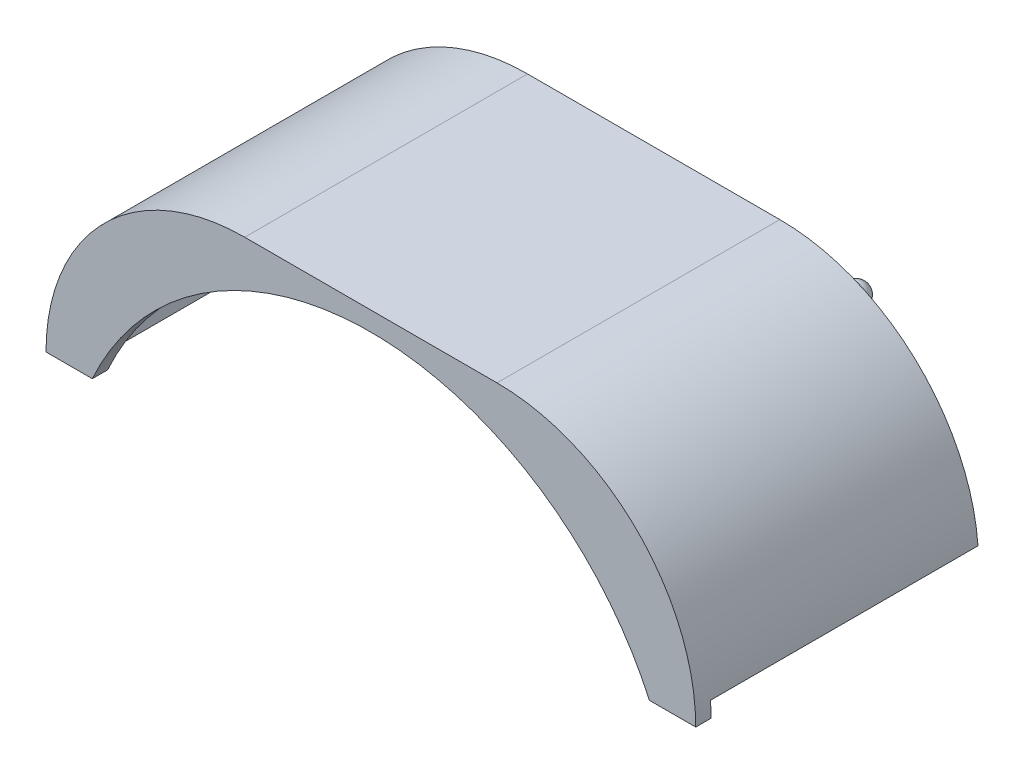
ISO-10303-21;
HEADER;
FILE_DESCRIPTION(('STEP AP214'),'2;1');
FILE_NAME('part.step','',(''),(''),'','','');
FILE_SCHEMA(('AUTOMOTIVE_DESIGN { 1 0 10303 214 1 1 1 1 }'));
ENDSEC;
DATA;
#1=APPLICATION_CONTEXT('core data for automotive mechanical design processes');
#2=APPLICATION_PROTOCOL_DEFINITION('international standard','automotive_design',2000,#1);
#3=PRODUCT_CONTEXT('',#1,'mechanical');
#4=PRODUCT('Part','Part','',(#3));
#5=PRODUCT_RELATED_PRODUCT_CATEGORY('part','',(#4));
#6=PRODUCT_DEFINITION_FORMATION('','',#4);
#7=PRODUCT_DEFINITION_CONTEXT('part definition',#1,'design');
#8=PRODUCT_DEFINITION('design','',#6,#7);
#9=PRODUCT_DEFINITION_SHAPE('','',#8);
#10=(LENGTH_UNIT() NAMED_UNIT(*) SI_UNIT(.MILLI.,.METRE.));
#11=(NAMED_UNIT(*) PLANE_ANGLE_UNIT() SI_UNIT($,.RADIAN.));
#12=(NAMED_UNIT(*) SI_UNIT($,.STERADIAN.) SOLID_ANGLE_UNIT());
#13=UNCERTAINTY_MEASURE_WITH_UNIT(LENGTH_MEASURE(1.E-05),#10,'distance_accuracy_value','');
#14=(GEOMETRIC_REPRESENTATION_CONTEXT(3) GLOBAL_UNCERTAINTY_ASSIGNED_CONTEXT((#13)) GLOBAL_UNIT_ASSIGNED_CONTEXT((#10,
#11,#12)) REPRESENTATION_CONTEXT('',''));
#15=CARTESIAN_POINT('',(0.,0.,0.));
#16=DIRECTION('',(0.,0.,1.));
#17=DIRECTION('',(1.,0.,0.));
#18=AXIS2_PLACEMENT_3D('',#15,#16,#17);
#19=CARTESIAN_POINT('',(-16.5000000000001,16.5,-2.07368844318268E-10));
#20=DIRECTION('',(0.,0.,1.));
#21=DIRECTION('',(1.,0.,0.));
#22=AXIS2_PLACEMENT_3D('',#19,#20,#21);
#23=PLANE('',#22);
#24=CARTESIAN_POINT('',(25.,37.5000000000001,0.));
#25=DIRECTION('',(0.,0.,-1.));
#26=DIRECTION('',(-1.,0.,0.));
#27=AXIS2_PLACEMENT_3D('',#24,#25,#26);
#28=CIRCLE('',#27,1.5);
#29=CARTESIAN_POINT('',(23.5,37.5000000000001,0.));
#30=VERTEX_POINT('',#29);
#31=CARTESIAN_POINT('',(26.5,37.5000000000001,-2.07368844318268E-10));
#32=VERTEX_POINT('',#31);
#33=EDGE_CURVE('E294',#30,#32,#28,.T.);
#34=ORIENTED_EDGE('',*,*,#33,.F.);
#35=DIRECTION('',(0.,-1.,0.));
#36=VECTOR('',#35,1.);
#37=CARTESIAN_POINT('',(23.5,37.5000000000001,-2.07368844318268E-10));
#38=LINE('',#37,#36);
#39=CARTESIAN_POINT('',(23.5,40.5000000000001,-2.07368844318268E-10));
#40=VERTEX_POINT('',#39);
#41=EDGE_CURVE('E298',#40,#30,#38,.T.);
#42=ORIENTED_EDGE('',*,*,#41,.F.);
#43=CARTESIAN_POINT('',(16.5000000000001,16.5,-2.07368844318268E-10));
#44=DIRECTION('',(0.,0.,-1.));
#45=DIRECTION('',(1.,0.,0.));
#46=AXIS2_PLACEMENT_3D('',#43,#44,#45);
#47=CIRCLE('',#46,25.0000000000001);
#48=CARTESIAN_POINT('',(18.,41.4549594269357,0.));
#49=VERTEX_POINT('',#48);
#50=EDGE_CURVE('E320',#49,#40,#47,.T.);
#51=ORIENTED_EDGE('',*,*,#50,.F.);
#52=DIRECTION('',(0.,-1.,0.));
#53=VECTOR('',#52,1.);
#54=CARTESIAN_POINT('',(18.,37.5000000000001,0.));
#55=LINE('',#54,#53);
#56=CARTESIAN_POINT('',(18.,41.5000000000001,0.));
#57=VERTEX_POINT('',#56);
#58=EDGE_CURVE('E633',#57,#49,#55,.T.);
#59=ORIENTED_EDGE('',*,*,#58,.F.);
#60=DIRECTION('',(1.,0.,0.));
#61=VECTOR('',#60,1.);
#62=CARTESIAN_POINT('',(-16.,41.5000000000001,-2.07368844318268E-10));
#63=LINE('',#62,#61);
#64=CARTESIAN_POINT('',(-18.,41.5000000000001,0.));
#65=VERTEX_POINT('',#64);
#66=EDGE_CURVE('E324',#65,#57,#63,.T.);
#67=ORIENTED_EDGE('',*,*,#66,.F.);
#68=DIRECTION('',(0.,1.,0.));
#69=VECTOR('',#68,1.);
#70=CARTESIAN_POINT('',(-18.,37.5000000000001,0.));
#71=LINE('',#70,#69);
#72=CARTESIAN_POINT('',(-18.,41.4549594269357,0.));
#73=VERTEX_POINT('',#72);
#74=EDGE_CURVE('E659',#73,#65,#71,.T.);
#75=ORIENTED_EDGE('',*,*,#74,.F.);
#76=CARTESIAN_POINT('',(-16.5000000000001,16.5,-2.07368844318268E-10));
#77=DIRECTION('',(0.,0.,-1.));
#78=DIRECTION('',(1.,0.,0.));
#79=AXIS2_PLACEMENT_3D('',#76,#77,#78);
#80=CIRCLE('',#79,25.0000000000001);
#81=CARTESIAN_POINT('',(-23.5,40.5000000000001,-2.07368844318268E-10));
#82=VERTEX_POINT('',#81);
#83=EDGE_CURVE('E620',#82,#73,#80,.T.);
#84=ORIENTED_EDGE('',*,*,#83,.F.);
#85=DIRECTION('',(0.,1.,0.));
#86=VECTOR('',#85,1.);
#87=CARTESIAN_POINT('',(-23.5,40.5000000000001,-2.07368844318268E-10));
#88=LINE('',#87,#86);
#89=CARTESIAN_POINT('',(-23.5,37.5000000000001,-2.07368844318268E-10));
#90=VERTEX_POINT('',#89);
#91=EDGE_CURVE('E617',#90,#82,#88,.T.);
#92=ORIENTED_EDGE('',*,*,#91,.F.);
#93=CARTESIAN_POINT('',(-25.,37.5000000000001,0.));
#94=DIRECTION('',(0.,0.,-1.));
#95=DIRECTION('',(-1.,0.,0.));
#96=AXIS2_PLACEMENT_3D('',#93,#94,#95);
#97=CIRCLE('',#96,1.50000000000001);
#98=CARTESIAN_POINT('',(-26.5,37.5000000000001,0.));
#99=VERTEX_POINT('',#98);
#100=EDGE_CURVE('E305',#99,#90,#97,.T.);
#101=ORIENTED_EDGE('',*,*,#100,.F.);
#102=DIRECTION('',(0.,-1.,0.));
#103=VECTOR('',#102,1.);
#104=CARTESIAN_POINT('',(-26.5,37.5000000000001,-2.07368844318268E-10));
#105=LINE('',#104,#103);
#106=CARTESIAN_POINT('',(-26.5,39.4128784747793,-2.07368844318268E-10));
#107=VERTEX_POINT('',#106);
#108=EDGE_CURVE('E614',#107,#99,#105,.T.);
#109=ORIENTED_EDGE('',*,*,#108,.F.);
#110=CARTESIAN_POINT('',(-16.5000000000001,16.5,-2.07368844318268E-10));
#111=DIRECTION('',(0.,0.,-1.));
#112=DIRECTION('',(1.,0.,0.));
#113=AXIS2_PLACEMENT_3D('',#110,#111,#112);
#114=CIRCLE('',#113,25.0000000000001);
#115=CARTESIAN_POINT('',(-38.5000000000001,28.374342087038,-2.07368844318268E-10));
#116=VERTEX_POINT('',#115);
#117=EDGE_CURVE('E612',#116,#107,#114,.T.);
#118=ORIENTED_EDGE('',*,*,#117,.F.);
#119=DIRECTION('',(0.,1.,0.));
#120=VECTOR('',#119,1.);
#121=CARTESIAN_POINT('',(-38.5000000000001,16.5,-2.07368844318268E-10));
#122=LINE('',#121,#120);
#123=CARTESIAN_POINT('',(-38.5000000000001,16.5,-2.07368844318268E-10));
#124=VERTEX_POINT('',#123);
#125=EDGE_CURVE('E593',#124,#116,#122,.T.);
#126=ORIENTED_EDGE('',*,*,#125,.F.);
#127=DIRECTION('',(1.,0.,0.));
#128=VECTOR('',#127,1.);
#129=CARTESIAN_POINT('',(-39.5000000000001,16.5,-2.07368844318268E-10));
#130=LINE('',#129,#128);
#131=CARTESIAN_POINT('',(-39.5000000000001,16.5,-2.07368844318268E-10));
#132=VERTEX_POINT('',#131);
#133=EDGE_CURVE('E607',#132,#124,#130,.T.);
#134=ORIENTED_EDGE('',*,*,#133,.F.);
#135=DIRECTION('',(0.,-1.,0.));
#136=VECTOR('',#135,1.);
#137=CARTESIAN_POINT('',(-39.5000000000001,16.5,-2.07368844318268E-10));
#138=LINE('',#137,#136);
#139=CARTESIAN_POINT('',(-39.5000000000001,18.5,-2.07368844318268E-10));
#140=VERTEX_POINT('',#139);
#141=EDGE_CURVE('E354',#140,#132,#138,.T.);
#142=ORIENTED_EDGE('',*,*,#141,.F.);
#143=DIRECTION('',(1.,0.,0.));
#144=VECTOR('',#143,1.);
#145=CARTESIAN_POINT('',(-39.5000000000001,18.5,-2.07368844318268E-10));
#146=LINE('',#145,#144);
#147=CARTESIAN_POINT('',(-42.4229627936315,18.5,-2.07368844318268E-10));
#148=VERTEX_POINT('',#147);
#149=EDGE_CURVE('E351',#148,#140,#146,.T.);
#150=ORIENTED_EDGE('',*,*,#149,.F.);
#151=CARTESIAN_POINT('',(-16.5000000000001,16.5,-2.07368844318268E-10));
#152=DIRECTION('',(0.,0.,1.));
#153=DIRECTION('',(1.,0.,0.));
#154=AXIS2_PLACEMENT_3D('',#151,#152,#153);
#155=CIRCLE('',#154,26.);
#156=CARTESIAN_POINT('',(-16.5000000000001,42.5,-2.07368844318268E-10));
#157=VERTEX_POINT('',#156);
#158=EDGE_CURVE('E348',#157,#148,#155,.T.);
#159=ORIENTED_EDGE('',*,*,#158,.F.);
#160=DIRECTION('',(-1.,0.,0.));
#161=VECTOR('',#160,1.);
#162=CARTESIAN_POINT('',(16.5000000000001,42.5000000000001,-2.07368844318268E-10));
#163=LINE('',#162,#161);
#164=CARTESIAN_POINT('',(16.5000000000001,42.5000000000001,-2.07368844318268E-10));
#165=VERTEX_POINT('',#164);
#166=EDGE_CURVE('E345',#165,#157,#163,.T.);
#167=ORIENTED_EDGE('',*,*,#166,.F.);
#168=CARTESIAN_POINT('',(16.5000000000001,16.5,-2.07368844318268E-10));
#169=DIRECTION('',(0.,0.,1.));
#170=DIRECTION('',(1.,0.,0.));
#171=AXIS2_PLACEMENT_3D('',#168,#169,#170);
#172=CIRCLE('',#171,26.0000000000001);
#173=CARTESIAN_POINT('',(42.4229627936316,18.5,-2.07368844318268E-10));
#174=VERTEX_POINT('',#173);
#175=EDGE_CURVE('E342',#174,#165,#172,.T.);
#176=ORIENTED_EDGE('',*,*,#175,.F.);
#177=DIRECTION('',(1.,0.,0.));
#178=VECTOR('',#177,1.);
#179=CARTESIAN_POINT('',(39.5000000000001,18.5,-2.07368844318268E-10));
#180=LINE('',#179,#178);
#181=CARTESIAN_POINT('',(39.5000000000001,18.5,-2.07368844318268E-10));
#182=VERTEX_POINT('',#181);
#183=EDGE_CURVE('E339',#182,#174,#180,.T.);
#184=ORIENTED_EDGE('',*,*,#183,.F.);
#185=DIRECTION('',(0.,1.,0.));
#186=VECTOR('',#185,1.);
#187=CARTESIAN_POINT('',(39.5000000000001,18.5,-2.07368844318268E-10));
#188=LINE('',#187,#186);
#189=CARTESIAN_POINT('',(39.5000000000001,16.5,-2.07368844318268E-10));
#190=VERTEX_POINT('',#189);
#191=EDGE_CURVE('E336',#190,#182,#188,.T.);
#192=ORIENTED_EDGE('',*,*,#191,.F.);
#193=DIRECTION('',(1.,0.,0.));
#194=VECTOR('',#193,1.);
#195=CARTESIAN_POINT('',(39.5000000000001,16.5,-2.07368844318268E-10));
#196=LINE('',#195,#194);
#197=CARTESIAN_POINT('',(38.5000000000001,16.5,-2.07368844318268E-10));
#198=VERTEX_POINT('',#197);
#199=EDGE_CURVE('E333',#198,#190,#196,.T.);
#200=ORIENTED_EDGE('',*,*,#199,.F.);
#201=DIRECTION('',(0.,-1.,0.));
#202=VECTOR('',#201,1.);
#203=CARTESIAN_POINT('',(38.5000000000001,16.5,-2.07368844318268E-10));
#204=LINE('',#203,#202);
#205=CARTESIAN_POINT('',(38.5000000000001,28.374342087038,-2.07368844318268E-10));
#206=VERTEX_POINT('',#205);
#207=EDGE_CURVE('E330',#206,#198,#204,.T.);
#208=ORIENTED_EDGE('',*,*,#207,.F.);
#209=CARTESIAN_POINT('',(16.5000000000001,16.5,-2.07368844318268E-10));
#210=DIRECTION('',(0.,0.,-1.));
#211=DIRECTION('',(1.,0.,0.));
#212=AXIS2_PLACEMENT_3D('',#209,#210,#211);
#213=CIRCLE('',#212,25.0000000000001);
#214=CARTESIAN_POINT('',(26.5,39.4128784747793,-2.07368844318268E-10));
#215=VERTEX_POINT('',#214);
#216=EDGE_CURVE('E322',#215,#206,#213,.T.);
#217=ORIENTED_EDGE('',*,*,#216,.F.);
#218=DIRECTION('',(0.,1.,0.));
#219=VECTOR('',#218,1.);
#220=CARTESIAN_POINT('',(26.5,39.4128784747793,-2.07368844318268E-10));
#221=LINE('',#220,#219);
#222=EDGE_CURVE('E301',#32,#215,#221,.T.);
#223=ORIENTED_EDGE('',*,*,#222,.F.);
#224=EDGE_LOOP('',(#34,#42,#51,#59,#67,#75,#84,#92,#101,#109,#118,#126,#134,#142,#150,#159,#167,
#176,#184,#192,#200,#208,#217,#223));
#225=FACE_BOUND('',#224,.T.);
#226=ADVANCED_FACE('F36',(#225),#23,.F.);
#227=CARTESIAN_POINT('',(-16.,37.5000000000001,123.740245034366));
#228=DIRECTION('',(-1.,0.,0.));
#229=DIRECTION('',(0.,0.,1.));
#230=AXIS2_PLACEMENT_3D('',#227,#228,#229);
#231=PLANE('',#230);
#232=DIRECTION('',(0.,-1.,0.));
#233=VECTOR('',#232,1.);
#234=CARTESIAN_POINT('',(-16.,37.5000000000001,30.));
#235=LINE('',#234,#233);
#236=CARTESIAN_POINT('',(-16.,41.5000000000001,30.));
#237=VERTEX_POINT('',#236);
#238=CARTESIAN_POINT('',(-16.,37.5000000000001,30.));
#239=VERTEX_POINT('',#238);
#240=EDGE_CURVE('E666',#237,#239,#235,.T.);
#241=ORIENTED_EDGE('',*,*,#240,.F.);
#242=DIRECTION('',(0.,0.,-1.));
#243=VECTOR('',#242,1.);
#244=CARTESIAN_POINT('',(-16.,41.5000000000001,123.740245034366));
#245=LINE('',#244,#243);
#246=CARTESIAN_POINT('',(-16.,41.5000000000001,35.));
#247=VERTEX_POINT('',#246);
#248=EDGE_CURVE('E399',#247,#237,#245,.T.);
#249=ORIENTED_EDGE('',*,*,#248,.F.);
#250=DIRECTION('',(0.,-1.,0.));
#251=VECTOR('',#250,1.);
#252=CARTESIAN_POINT('',(-16.,37.5000000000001,35.));
#253=LINE('',#252,#251);
#254=CARTESIAN_POINT('',(-16.,37.5000000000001,35.));
#255=VERTEX_POINT('',#254);
#256=EDGE_CURVE('E758',#247,#255,#253,.T.);
#257=ORIENTED_EDGE('',*,*,#256,.T.);
#258=DIRECTION('',(0.,0.,-1.));
#259=VECTOR('',#258,1.);
#260=CARTESIAN_POINT('',(-16.,37.5000000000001,123.740245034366));
#261=LINE('',#260,#259);
#262=EDGE_CURVE('E402',#255,#239,#261,.T.);
#263=ORIENTED_EDGE('',*,*,#262,.T.);
#264=EDGE_LOOP('',(#241,#249,#257,#263));
#265=FACE_BOUND('',#264,.T.);
#266=ADVANCED_FACE('F459',(#265),#231,.F.);
#267=CARTESIAN_POINT('',(-18.,37.5000000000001,123.740245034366));
#268=DIRECTION('',(0.,1.,0.));
#269=DIRECTION('',(0.,0.,1.));
#270=AXIS2_PLACEMENT_3D('',#267,#268,#269);
#271=PLANE('',#270);
#272=DIRECTION('',(-1.,0.,0.));
#273=VECTOR('',#272,1.);
#274=CARTESIAN_POINT('',(-18.,37.5000000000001,30.));
#275=LINE('',#274,#273);
#276=CARTESIAN_POINT('',(-18.,37.5000000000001,30.));
#277=VERTEX_POINT('',#276);
#278=EDGE_CURVE('E668',#239,#277,#275,.T.);
#279=ORIENTED_EDGE('',*,*,#278,.F.);
#280=ORIENTED_EDGE('',*,*,#262,.F.);
#281=DIRECTION('',(-1.,0.,0.));
#282=VECTOR('',#281,1.);
#283=CARTESIAN_POINT('',(-18.,37.5000000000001,35.));
#284=LINE('',#283,#282);
#285=CARTESIAN_POINT('',(-18.,37.5000000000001,35.));
#286=VERTEX_POINT('',#285);
#287=EDGE_CURVE('E761',#255,#286,#284,.T.);
#288=ORIENTED_EDGE('',*,*,#287,.T.);
#289=DIRECTION('',(0.,0.,-1.));
#290=VECTOR('',#289,1.);
#291=CARTESIAN_POINT('',(-18.,37.5000000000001,123.740245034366));
#292=LINE('',#291,#290);
#293=EDGE_CURVE('E405',#286,#277,#292,.T.);
#294=ORIENTED_EDGE('',*,*,#293,.T.);
#295=EDGE_LOOP('',(#279,#280,#288,#294));
#296=FACE_BOUND('',#295,.T.);
#297=ADVANCED_FACE('F464',(#296),#271,.F.);
#298=CARTESIAN_POINT('',(-18.,38.5000000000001,123.740245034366));
#299=DIRECTION('',(1.,0.,0.));
#300=DIRECTION('',(0.,0.,-1.));
#301=AXIS2_PLACEMENT_3D('',#298,#299,#300);
#302=PLANE('',#301);
#303=DIRECTION('',(0.,1.,0.));
#304=VECTOR('',#303,1.);
#305=CARTESIAN_POINT('',(-18.,37.5000000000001,30.));
#306=LINE('',#305,#304);
#307=CARTESIAN_POINT('',(-18.,38.5000000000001,30.));
#308=VERTEX_POINT('',#307);
#309=EDGE_CURVE('E662',#277,#308,#306,.T.);
#310=ORIENTED_EDGE('',*,*,#309,.F.);
#311=ORIENTED_EDGE('',*,*,#293,.F.);
#312=DIRECTION('',(0.,1.,0.));
#313=VECTOR('',#312,1.);
#314=CARTESIAN_POINT('',(-18.,38.5000000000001,35.));
#315=LINE('',#314,#313);
#316=CARTESIAN_POINT('',(-18.,38.5000000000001,35.));
#317=VERTEX_POINT('',#316);
#318=EDGE_CURVE('E764',#286,#317,#315,.T.);
#319=ORIENTED_EDGE('',*,*,#318,.T.);
#320=DIRECTION('',(0.,0.,-1.));
#321=VECTOR('',#320,1.);
#322=CARTESIAN_POINT('',(-18.,38.5000000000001,123.740245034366));
#323=LINE('',#322,#321);
#324=EDGE_CURVE('E408',#317,#308,#323,.T.);
#325=ORIENTED_EDGE('',*,*,#324,.T.);
#326=EDGE_LOOP('',(#310,#311,#319,#325));
#327=FACE_BOUND('',#326,.T.);
#328=ADVANCED_FACE('F550',(#327),#302,.F.);
#329=CARTESIAN_POINT('',(-17.,38.5000000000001,123.740245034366));
#330=DIRECTION('',(0.,-1.,0.));
#331=DIRECTION('',(0.,0.,-1.));
#332=AXIS2_PLACEMENT_3D('',#329,#330,#331);
#333=PLANE('',#332);
#334=DIRECTION('',(1.,0.,0.));
#335=VECTOR('',#334,1.);
#336=CARTESIAN_POINT('',(-17.,38.5000000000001,30.));
#337=LINE('',#336,#335);
#338=CARTESIAN_POINT('',(-17.,38.5000000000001,30.));
#339=VERTEX_POINT('',#338);
#340=EDGE_CURVE('E672',#308,#339,#337,.T.);
#341=ORIENTED_EDGE('',*,*,#340,.F.);
#342=ORIENTED_EDGE('',*,*,#324,.F.);
#343=DIRECTION('',(1.,0.,0.));
#344=VECTOR('',#343,1.);
#345=CARTESIAN_POINT('',(-17.,38.5000000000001,35.));
#346=LINE('',#345,#344);
#347=CARTESIAN_POINT('',(-17.,38.5000000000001,35.));
#348=VERTEX_POINT('',#347);
#349=EDGE_CURVE('E767',#317,#348,#346,.T.);
#350=ORIENTED_EDGE('',*,*,#349,.T.);
#351=DIRECTION('',(0.,0.,-1.));
#352=VECTOR('',#351,1.);
#353=CARTESIAN_POINT('',(-17.,38.5000000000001,123.740245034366));
#354=LINE('',#353,#352);
#355=EDGE_CURVE('E411',#348,#339,#354,.T.);
#356=ORIENTED_EDGE('',*,*,#355,.T.);
#357=EDGE_LOOP('',(#341,#342,#350,#356));
#358=FACE_BOUND('',#357,.T.);
#359=ADVANCED_FACE('F554',(#358),#333,.F.);
#360=CARTESIAN_POINT('',(-17.,38.5000000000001,123.740245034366));
#361=DIRECTION('',(1.,0.,0.));
#362=DIRECTION('',(0.,0.,-1.));
#363=AXIS2_PLACEMENT_3D('',#360,#361,#362);
#364=PLANE('',#363);
#365=DIRECTION('',(0.,1.,0.));
#366=VECTOR('',#365,1.);
#367=CARTESIAN_POINT('',(-17.,38.5000000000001,30.));
#368=LINE('',#367,#366);
#369=CARTESIAN_POINT('',(-17.,41.4949994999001,30.));
#370=VERTEX_POINT('',#369);
#371=EDGE_CURVE('E59',#339,#370,#368,.T.);
#372=ORIENTED_EDGE('',*,*,#371,.F.);
#373=ORIENTED_EDGE('',*,*,#355,.F.);
#374=DIRECTION('',(0.,1.,0.));
#375=VECTOR('',#374,1.);
#376=CARTESIAN_POINT('',(-17.,38.5000000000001,35.));
#377=LINE('',#376,#375);
#378=CARTESIAN_POINT('',(-17.,41.4949994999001,35.));
#379=VERTEX_POINT('',#378);
#380=EDGE_CURVE('E770',#348,#379,#377,.T.);
#381=ORIENTED_EDGE('',*,*,#380,.T.);
#382=DIRECTION('',(0.,0.,-1.));
#383=VECTOR('',#382,1.);
#384=CARTESIAN_POINT('',(-17.,41.4949994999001,123.740245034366));
#385=LINE('',#384,#383);
#386=EDGE_CURVE('E414',#379,#370,#385,.T.);
#387=ORIENTED_EDGE('',*,*,#386,.T.);
#388=EDGE_LOOP('',(#372,#373,#381,#387));
#389=FACE_BOUND('',#388,.T.);
#390=ADVANCED_FACE('F475',(#389),#364,.F.);
#391=CARTESIAN_POINT('',(-39.5000000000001,16.5,123.740245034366));
#392=DIRECTION('',(1.,0.,0.));
#393=DIRECTION('',(0.,0.,-1.));
#394=AXIS2_PLACEMENT_3D('',#391,#392,#393);
#395=PLANE('',#394);
#396=DIRECTION('',(0.,0.,-1.));
#397=VECTOR('',#396,1.);
#398=CARTESIAN_POINT('',(-39.5000000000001,16.5,123.740245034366));
#399=LINE('',#398,#397);
#400=CARTESIAN_POINT('',(-39.5000000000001,16.5,35.));
#401=VERTEX_POINT('',#400);
#402=EDGE_CURVE('E357',#401,#132,#399,.T.);
#403=ORIENTED_EDGE('',*,*,#402,.F.);
#404=DIRECTION('',(0.,1.,0.));
#405=VECTOR('',#404,1.);
#406=CARTESIAN_POINT('',(-39.5000000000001,16.5,35.));
#407=LINE('',#406,#405);
#408=CARTESIAN_POINT('',(-39.5000000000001,18.5,35.));
#409=VERTEX_POINT('',#408);
#410=EDGE_CURVE('E431',#401,#409,#407,.T.);
#411=ORIENTED_EDGE('',*,*,#410,.T.);
#412=DIRECTION('',(0.,0.,-1.));
#413=VECTOR('',#412,1.);
#414=CARTESIAN_POINT('',(-39.5000000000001,18.5,123.740245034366));
#415=LINE('',#414,#413);
#416=EDGE_CURVE('E359',#409,#140,#415,.T.);
#417=ORIENTED_EDGE('',*,*,#416,.T.);
#418=ORIENTED_EDGE('',*,*,#141,.T.);
#419=EDGE_LOOP('',(#403,#411,#417,#418));
#420=FACE_BOUND('',#419,.T.);
#421=ADVANCED_FACE('F471',(#420),#395,.F.);
#422=CARTESIAN_POINT('',(-39.5000000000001,18.5,123.740245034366));
#423=DIRECTION('',(0.,1.,0.));
#424=DIRECTION('',(0.,0.,1.));
#425=AXIS2_PLACEMENT_3D('',#422,#423,#424);
#426=PLANE('',#425);
#427=ORIENTED_EDGE('',*,*,#416,.F.);
#428=DIRECTION('',(-1.,0.,0.));
#429=VECTOR('',#428,1.);
#430=CARTESIAN_POINT('',(-39.5000000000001,18.5,35.));
#431=LINE('',#430,#429);
#432=CARTESIAN_POINT('',(-42.4229627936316,18.5,35.));
#433=VERTEX_POINT('',#432);
#434=EDGE_CURVE('E434',#409,#433,#431,.T.);
#435=ORIENTED_EDGE('',*,*,#434,.T.);
#436=DIRECTION('',(0.,0.,-1.));
#437=VECTOR('',#436,1.);
#438=CARTESIAN_POINT('',(-42.4229627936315,18.5,123.740245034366));
#439=LINE('',#438,#437);
#440=EDGE_CURVE('E361',#433,#148,#439,.T.);
#441=ORIENTED_EDGE('',*,*,#440,.T.);
#442=ORIENTED_EDGE('',*,*,#149,.T.);
#443=EDGE_LOOP('',(#427,#435,#441,#442));
#444=FACE_BOUND('',#443,.T.);
#445=ADVANCED_FACE('F474',(#444),#426,.F.);
#446=CARTESIAN_POINT('',(-16.5000000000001,16.5,123.740245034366));
#447=DIRECTION('',(0.,0.,-1.));
#448=DIRECTION('',(-1.,0.,0.));
#449=AXIS2_PLACEMENT_3D('',#446,#447,#448);
#450=CYLINDRICAL_SURFACE('',#449,26.);
#451=ORIENTED_EDGE('',*,*,#440,.F.);
#452=CARTESIAN_POINT('',(-16.5000000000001,16.5000000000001,35.));
#453=DIRECTION('',(0.,0.,1.));
#454=DIRECTION('',(1.,0.,0.));
#455=AXIS2_PLACEMENT_3D('',#452,#453,#454);
#456=CIRCLE('',#455,26.);
#457=CARTESIAN_POINT('',(-42.5000000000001,16.5000000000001,35.));
#458=VERTEX_POINT('',#457);
#459=EDGE_CURVE('E679',#433,#458,#456,.T.);
#460=ORIENTED_EDGE('',*,*,#459,.T.);
#461=DIRECTION('',(0.,0.,-1.));
#462=VECTOR('',#461,1.);
#463=CARTESIAN_POINT('',(-42.5000000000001,16.5000000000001,125.887569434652));
#464=LINE('',#463,#462);
#465=CARTESIAN_POINT('',(-42.5000000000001,16.5000000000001,37.));
#466=VERTEX_POINT('',#465);
#467=EDGE_CURVE('E681',#466,#458,#464,.T.);
#468=ORIENTED_EDGE('',*,*,#467,.F.);
#469=CARTESIAN_POINT('',(-16.5000000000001,16.5000000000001,37.));
#470=DIRECTION('',(0.,0.,1.));
#471=DIRECTION('',(1.,0.,0.));
#472=AXIS2_PLACEMENT_3D('',#469,#470,#471);
#473=CIRCLE('',#472,26.);
#474=CARTESIAN_POINT('',(-16.5000000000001,42.5000000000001,37.));
#475=VERTEX_POINT('',#474);
#476=EDGE_CURVE('E610',#475,#466,#473,.T.);
#477=ORIENTED_EDGE('',*,*,#476,.F.);
#478=DIRECTION('',(0.,0.,-1.));
#479=VECTOR('',#478,1.);
#480=CARTESIAN_POINT('',(-16.5000000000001,42.5,123.740245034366));
#481=LINE('',#480,#479);
#482=EDGE_CURVE('E363',#475,#157,#481,.T.);
#483=ORIENTED_EDGE('',*,*,#482,.T.);
#484=ORIENTED_EDGE('',*,*,#158,.T.);
#485=EDGE_LOOP('',(#451,#460,#468,#477,#483,#484));
#486=FACE_BOUND('',#485,.T.);
#487=ADVANCED_FACE('F479',(#486),#450,.T.);
#488=CARTESIAN_POINT('',(16.5000000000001,42.5000000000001,123.740245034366));
#489=DIRECTION('',(0.,-1.,0.));
#490=DIRECTION('',(1.,0.,0.));
#491=AXIS2_PLACEMENT_3D('',#488,#489,#490);
#492=PLANE('',#491);
#493=ORIENTED_EDGE('',*,*,#482,.F.);
#494=DIRECTION('',(-1.,0.,0.));
#495=VECTOR('',#494,1.);
#496=CARTESIAN_POINT('',(-16.5000000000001,42.5000000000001,37.));
#497=LINE('',#496,#495);
#498=CARTESIAN_POINT('',(16.5000000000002,42.5000000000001,37.));
#499=VERTEX_POINT('',#498);
#500=EDGE_CURVE('E696',#499,#475,#497,.T.);
#501=ORIENTED_EDGE('',*,*,#500,.F.);
#502=DIRECTION('',(0.,0.,-1.));
#503=VECTOR('',#502,1.);
#504=CARTESIAN_POINT('',(16.5000000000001,42.5000000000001,123.740245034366));
#505=LINE('',#504,#503);
#506=EDGE_CURVE('E365',#499,#165,#505,.T.);
#507=ORIENTED_EDGE('',*,*,#506,.T.);
#508=ORIENTED_EDGE('',*,*,#166,.T.);
#509=EDGE_LOOP('',(#493,#501,#507,#508));
#510=FACE_BOUND('',#509,.T.);
#511=ADVANCED_FACE('F483',(#510),#492,.F.);
#512=CARTESIAN_POINT('',(16.5000000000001,16.5,123.740245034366));
#513=DIRECTION('',(0.,0.,-1.));
#514=DIRECTION('',(-1.,0.,0.));
#515=AXIS2_PLACEMENT_3D('',#512,#513,#514);
#516=CYLINDRICAL_SURFACE('',#515,26.0000000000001);
#517=ORIENTED_EDGE('',*,*,#506,.F.);
#518=CARTESIAN_POINT('',(16.5000000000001,16.5,37.));
#519=DIRECTION('',(0.,0.,1.));
#520=DIRECTION('',(1.,0.,0.));
#521=AXIS2_PLACEMENT_3D('',#518,#519,#520);
#522=CIRCLE('',#521,26.);
#523=CARTESIAN_POINT('',(42.5000000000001,16.5,37.));
#524=VERTEX_POINT('',#523);
#525=EDGE_CURVE('E699',#524,#499,#522,.T.);
#526=ORIENTED_EDGE('',*,*,#525,.F.);
#527=DIRECTION('',(0.,0.,-1.));
#528=VECTOR('',#527,1.);
#529=CARTESIAN_POINT('',(42.5000000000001,16.5,125.887569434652));
#530=LINE('',#529,#528);
#531=CARTESIAN_POINT('',(42.5000000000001,16.5,35.));
#532=VERTEX_POINT('',#531);
#533=EDGE_CURVE('E685',#524,#532,#530,.T.);
#534=ORIENTED_EDGE('',*,*,#533,.T.);
#535=CARTESIAN_POINT('',(16.5000000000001,16.5,35.));
#536=DIRECTION('',(0.,0.,1.));
#537=DIRECTION('',(1.,0.,0.));
#538=AXIS2_PLACEMENT_3D('',#535,#536,#537);
#539=CIRCLE('',#538,26.);
#540=CARTESIAN_POINT('',(42.4229627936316,18.5,35.));
#541=VERTEX_POINT('',#540);
#542=EDGE_CURVE('E682',#532,#541,#539,.T.);
#543=ORIENTED_EDGE('',*,*,#542,.T.);
#544=DIRECTION('',(0.,0.,-1.));
#545=VECTOR('',#544,1.);
#546=CARTESIAN_POINT('',(42.4229627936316,18.5,123.740245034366));
#547=LINE('',#546,#545);
#548=EDGE_CURVE('E367',#541,#174,#547,.T.);
#549=ORIENTED_EDGE('',*,*,#548,.T.);
#550=ORIENTED_EDGE('',*,*,#175,.T.);
#551=EDGE_LOOP('',(#517,#526,#534,#543,#549,#550));
#552=FACE_BOUND('',#551,.T.);
#553=ADVANCED_FACE('F487',(#552),#516,.T.);
#554=CARTESIAN_POINT('',(39.5000000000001,18.5,123.740245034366));
#555=DIRECTION('',(0.,1.,0.));
#556=DIRECTION('',(0.,0.,1.));
#557=AXIS2_PLACEMENT_3D('',#554,#555,#556);
#558=PLANE('',#557);
#559=ORIENTED_EDGE('',*,*,#548,.F.);
#560=DIRECTION('',(-1.,0.,0.));
#561=VECTOR('',#560,1.);
#562=CARTESIAN_POINT('',(39.5000000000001,18.5,35.));
#563=LINE('',#562,#561);
#564=CARTESIAN_POINT('',(39.5000000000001,18.5,35.));
#565=VERTEX_POINT('',#564);
#566=EDGE_CURVE('E719',#541,#565,#563,.T.);
#567=ORIENTED_EDGE('',*,*,#566,.T.);
#568=DIRECTION('',(0.,0.,-1.));
#569=VECTOR('',#568,1.);
#570=CARTESIAN_POINT('',(39.5000000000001,18.5,123.740245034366));
#571=LINE('',#570,#569);
#572=EDGE_CURVE('E369',#565,#182,#571,.T.);
#573=ORIENTED_EDGE('',*,*,#572,.T.);
#574=ORIENTED_EDGE('',*,*,#183,.T.);
#575=EDGE_LOOP('',(#559,#567,#573,#574));
#576=FACE_BOUND('',#575,.T.);
#577=ADVANCED_FACE('F491',(#576),#558,.F.);
#578=CARTESIAN_POINT('',(39.5000000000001,18.5,123.740245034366));
#579=DIRECTION('',(-1.,0.,0.));
#580=DIRECTION('',(0.,0.,1.));
#581=AXIS2_PLACEMENT_3D('',#578,#579,#580);
#582=PLANE('',#581);
#583=ORIENTED_EDGE('',*,*,#572,.F.);
#584=DIRECTION('',(0.,-1.,0.));
#585=VECTOR('',#584,1.);
#586=CARTESIAN_POINT('',(39.5000000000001,18.5,35.));
#587=LINE('',#586,#585);
#588=CARTESIAN_POINT('',(39.5000000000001,16.5,35.));
#589=VERTEX_POINT('',#588);
#590=EDGE_CURVE('E722',#565,#589,#587,.T.);
#591=ORIENTED_EDGE('',*,*,#590,.T.);
#592=DIRECTION('',(0.,0.,-1.));
#593=VECTOR('',#592,1.);
#594=CARTESIAN_POINT('',(39.5000000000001,16.5,123.740245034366));
#595=LINE('',#594,#593);
#596=EDGE_CURVE('E371',#589,#190,#595,.T.);
#597=ORIENTED_EDGE('',*,*,#596,.T.);
#598=ORIENTED_EDGE('',*,*,#191,.T.);
#599=EDGE_LOOP('',(#583,#591,#597,#598));
#600=FACE_BOUND('',#599,.T.);
#601=ADVANCED_FACE('F495',(#600),#582,.F.);
#602=CARTESIAN_POINT('',(39.5000000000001,16.5,123.740245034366));
#603=DIRECTION('',(0.,1.,0.));
#604=DIRECTION('',(0.,0.,1.));
#605=AXIS2_PLACEMENT_3D('',#602,#603,#604);
#606=PLANE('',#605);
#607=ORIENTED_EDGE('',*,*,#596,.F.);
#608=DIRECTION('',(1.,0.,0.));
#609=VECTOR('',#608,1.);
#610=CARTESIAN_POINT('',(36.4383040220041,16.5,35.));
#611=LINE('',#610,#609);
#612=EDGE_CURVE('E689',#589,#532,#611,.T.);
#613=ORIENTED_EDGE('',*,*,#612,.T.);
#614=ORIENTED_EDGE('',*,*,#533,.F.);
#615=DIRECTION('',(1.,0.,0.));
#616=VECTOR('',#615,1.);
#617=CARTESIAN_POINT('',(36.4383040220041,16.5,37.));
#618=LINE('',#617,#616);
#619=CARTESIAN_POINT('',(36.4383040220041,16.5,37.));
#620=VERTEX_POINT('',#619);
#621=EDGE_CURVE('E702',#620,#524,#618,.T.);
#622=ORIENTED_EDGE('',*,*,#621,.F.);
#623=DIRECTION('',(0.,0.,-1.));
#624=VECTOR('',#623,1.);
#625=CARTESIAN_POINT('',(36.4383040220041,16.5,125.887569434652));
#626=LINE('',#625,#624);
#627=CARTESIAN_POINT('',(36.4383040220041,16.5,35.));
#628=VERTEX_POINT('',#627);
#629=EDGE_CURVE('E693',#620,#628,#626,.T.);
#630=ORIENTED_EDGE('',*,*,#629,.T.);
#631=CARTESIAN_POINT('',(38.5000000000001,16.5,35.));
#632=VERTEX_POINT('',#631);
#633=EDGE_CURVE('E686',#628,#632,#611,.T.);
#634=ORIENTED_EDGE('',*,*,#633,.T.);
#635=DIRECTION('',(0.,0.,-1.));
#636=VECTOR('',#635,1.);
#637=CARTESIAN_POINT('',(38.5000000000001,16.5,123.740245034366));
#638=LINE('',#637,#636);
#639=EDGE_CURVE('E373',#632,#198,#638,.T.);
#640=ORIENTED_EDGE('',*,*,#639,.T.);
#641=ORIENTED_EDGE('',*,*,#199,.T.);
#642=EDGE_LOOP('',(#607,#613,#614,#622,#630,#634,#640,#641));
#643=FACE_BOUND('',#642,.T.);
#644=ADVANCED_FACE('F499',(#643),#606,.F.);
#645=CARTESIAN_POINT('',(38.5000000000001,16.5,123.740245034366));
#646=DIRECTION('',(1.,0.,0.));
#647=DIRECTION('',(0.,0.,-1.));
#648=AXIS2_PLACEMENT_3D('',#645,#646,#647);
#649=PLANE('',#648);
#650=ORIENTED_EDGE('',*,*,#639,.F.);
#651=DIRECTION('',(0.,1.,0.));
#652=VECTOR('',#651,1.);
#653=CARTESIAN_POINT('',(38.5000000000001,16.5,35.));
#654=LINE('',#653,#652);
#655=CARTESIAN_POINT('',(38.5000000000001,28.374342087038,35.));
#656=VERTEX_POINT('',#655);
#657=EDGE_CURVE('E725',#632,#656,#654,.T.);
#658=ORIENTED_EDGE('',*,*,#657,.T.);
#659=DIRECTION('',(0.,0.,-1.));
#660=VECTOR('',#659,1.);
#661=CARTESIAN_POINT('',(38.5000000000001,28.374342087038,123.740245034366));
#662=LINE('',#661,#660);
#663=EDGE_CURVE('E375',#656,#206,#662,.T.);
#664=ORIENTED_EDGE('',*,*,#663,.T.);
#665=ORIENTED_EDGE('',*,*,#207,.T.);
#666=EDGE_LOOP('',(#650,#658,#664,#665));
#667=FACE_BOUND('',#666,.T.);
#668=ADVANCED_FACE('F503',(#667),#649,.F.);
#669=CARTESIAN_POINT('',(16.5000000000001,16.5,123.740245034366));
#670=DIRECTION('',(0.,0.,-1.));
#671=DIRECTION('',(-1.,0.,0.));
#672=AXIS2_PLACEMENT_3D('',#669,#670,#671);
#673=CYLINDRICAL_SURFACE('',#672,25.0000000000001);
#674=ORIENTED_EDGE('',*,*,#663,.F.);
#675=CARTESIAN_POINT('',(16.5000000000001,16.5,35.));
#676=DIRECTION('',(0.,0.,-1.));
#677=DIRECTION('',(-1.,0.,0.));
#678=AXIS2_PLACEMENT_3D('',#675,#676,#677);
#679=CIRCLE('',#678,25.0000000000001);
#680=CARTESIAN_POINT('',(26.5,39.4128784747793,35.));
#681=VERTEX_POINT('',#680);
#682=EDGE_CURVE('E728',#656,#681,#679,.F.);
#683=ORIENTED_EDGE('',*,*,#682,.T.);
#684=DIRECTION('',(0.,0.,-1.));
#685=VECTOR('',#684,1.);
#686=CARTESIAN_POINT('',(26.5,39.4128784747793,123.740245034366));
#687=LINE('',#686,#685);
#688=EDGE_CURVE('E377',#681,#215,#687,.T.);
#689=ORIENTED_EDGE('',*,*,#688,.T.);
#690=ORIENTED_EDGE('',*,*,#216,.T.);
#691=EDGE_LOOP('',(#674,#683,#689,#690));
#692=FACE_BOUND('',#691,.T.);
#693=ADVANCED_FACE('F507',(#692),#673,.F.);
#694=CARTESIAN_POINT('',(26.5,39.4128784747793,123.740245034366));
#695=DIRECTION('',(-1.,0.,0.));
#696=DIRECTION('',(0.,0.,1.));
#697=AXIS2_PLACEMENT_3D('',#694,#695,#696);
#698=PLANE('',#697);
#699=ORIENTED_EDGE('',*,*,#688,.F.);
#700=DIRECTION('',(0.,-1.,0.));
#701=VECTOR('',#700,1.);
#702=CARTESIAN_POINT('',(26.5,39.4128784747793,35.));
#703=LINE('',#702,#701);
#704=CARTESIAN_POINT('',(26.5,37.5000000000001,35.));
#705=VERTEX_POINT('',#704);
#706=EDGE_CURVE('E731',#681,#705,#703,.T.);
#707=ORIENTED_EDGE('',*,*,#706,.T.);
#708=DIRECTION('',(0.,0.,-1.));
#709=VECTOR('',#708,1.);
#710=CARTESIAN_POINT('',(26.5,37.5000000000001,123.740245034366));
#711=LINE('',#710,#709);
#712=EDGE_CURVE('E315',#705,#32,#711,.T.);
#713=ORIENTED_EDGE('',*,*,#712,.T.);
#714=ORIENTED_EDGE('',*,*,#222,.T.);
#715=EDGE_LOOP('',(#699,#707,#713,#714));
#716=FACE_BOUND('',#715,.T.);
#717=ADVANCED_FACE('F511',(#716),#698,.F.);
#718=CARTESIAN_POINT('',(25.,37.5000000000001,123.740245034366));
#719=DIRECTION('',(0.,0.,-1.));
#720=DIRECTION('',(-1.,0.,0.));
#721=AXIS2_PLACEMENT_3D('',#718,#719,#720);
#722=CYLINDRICAL_SURFACE('',#721,1.5);
#723=CARTESIAN_POINT('',(25.,37.5000000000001,-1.49999999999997));
#724=DIRECTION('',(0.,0.,-1.));
#725=DIRECTION('',(-1.,0.,0.));
#726=AXIS2_PLACEMENT_3D('',#723,#724,#725);
#727=CIRCLE('',#726,1.5);
#728=CARTESIAN_POINT('',(23.5,37.5000000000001,-1.49999999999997));
#729=VERTEX_POINT('',#728);
#730=EDGE_CURVE('E44',#729,#729,#727,.F.);
#731=ORIENTED_EDGE('',*,*,#730,.T.);
#732=EDGE_LOOP('',(#731));
#733=FACE_BOUND('',#732,.T.);
#734=ORIENTED_EDGE('',*,*,#712,.F.);
#735=CARTESIAN_POINT('',(25.,37.5000000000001,35.));
#736=DIRECTION('',(0.,0.,-1.));
#737=DIRECTION('',(-1.,0.,0.));
#738=AXIS2_PLACEMENT_3D('',#735,#736,#737);
#739=CIRCLE('',#738,1.5);
#740=CARTESIAN_POINT('',(23.5,37.5000000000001,35.));
#741=VERTEX_POINT('',#740);
#742=EDGE_CURVE('E311',#705,#741,#739,.T.);
#743=ORIENTED_EDGE('',*,*,#742,.T.);
#744=DIRECTION('',(0.,0.,-1.));
#745=VECTOR('',#744,1.);
#746=CARTESIAN_POINT('',(23.5,37.5000000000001,123.740245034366));
#747=LINE('',#746,#745);
#748=EDGE_CURVE('E309',#741,#30,#747,.T.);
#749=ORIENTED_EDGE('',*,*,#748,.T.);
#750=ORIENTED_EDGE('',*,*,#33,.T.);
#751=EDGE_LOOP('',(#734,#743,#749,#750));
#752=FACE_BOUND('',#751,.T.);
#753=ADVANCED_FACE('F310',(#733,#752),#722,.T.);
#754=CARTESIAN_POINT('',(23.5,37.5000000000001,123.740245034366));
#755=DIRECTION('',(1.,0.,0.));
#756=DIRECTION('',(0.,1.,0.));
#757=AXIS2_PLACEMENT_3D('',#754,#755,#756);
#758=PLANE('',#757);
#759=ORIENTED_EDGE('',*,*,#748,.F.);
#760=DIRECTION('',(0.,1.,0.));
#761=VECTOR('',#760,1.);
#762=CARTESIAN_POINT('',(23.5,37.5000000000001,35.));
#763=LINE('',#762,#761);
#764=CARTESIAN_POINT('',(23.5,40.5000000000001,35.));
#765=VERTEX_POINT('',#764);
#766=EDGE_CURVE('E735',#741,#765,#763,.T.);
#767=ORIENTED_EDGE('',*,*,#766,.T.);
#768=DIRECTION('',(0.,0.,-1.));
#769=VECTOR('',#768,1.);
#770=CARTESIAN_POINT('',(23.5,40.5000000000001,123.740245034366));
#771=LINE('',#770,#769);
#772=EDGE_CURVE('E314',#765,#40,#771,.T.);
#773=ORIENTED_EDGE('',*,*,#772,.T.);
#774=ORIENTED_EDGE('',*,*,#41,.T.);
#775=EDGE_LOOP('',(#759,#767,#773,#774));
#776=FACE_BOUND('',#775,.T.);
#777=ADVANCED_FACE('F318',(#776),#758,.F.);
#778=CARTESIAN_POINT('',(16.5000000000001,16.5,123.740245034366));
#779=DIRECTION('',(0.,0.,-1.));
#780=DIRECTION('',(-1.,0.,0.));
#781=AXIS2_PLACEMENT_3D('',#778,#779,#780);
#782=CYLINDRICAL_SURFACE('',#781,25.0000000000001);
#783=CARTESIAN_POINT('',(16.5000000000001,16.5,30.));
#784=DIRECTION('',(0.,0.,1.));
#785=DIRECTION('',(1.,0.,0.));
#786=AXIS2_PLACEMENT_3D('',#783,#784,#785);
#787=CIRCLE('',#786,25.0000000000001);
#788=CARTESIAN_POINT('',(17.,41.4949994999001,30.));
#789=VERTEX_POINT('',#788);
#790=CARTESIAN_POINT('',(18.,41.4549594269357,30.));
#791=VERTEX_POINT('',#790);
#792=EDGE_CURVE('E654',#789,#791,#787,.F.);
#793=ORIENTED_EDGE('',*,*,#792,.T.);
#794=DIRECTION('',(0.,0.,-1.));
#795=VECTOR('',#794,1.);
#796=CARTESIAN_POINT('',(18.,41.4549594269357,123.740245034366));
#797=LINE('',#796,#795);
#798=EDGE_CURVE('E657',#791,#49,#797,.T.);
#799=ORIENTED_EDGE('',*,*,#798,.T.);
#800=ORIENTED_EDGE('',*,*,#50,.T.);
#801=ORIENTED_EDGE('',*,*,#772,.F.);
#802=CARTESIAN_POINT('',(16.5000000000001,16.5,35.));
#803=DIRECTION('',(0.,0.,-1.));
#804=DIRECTION('',(-1.,0.,0.));
#805=AXIS2_PLACEMENT_3D('',#802,#803,#804);
#806=CIRCLE('',#805,25.0000000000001);
#807=CARTESIAN_POINT('',(17.,41.4949994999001,35.));
#808=VERTEX_POINT('',#807);
#809=EDGE_CURVE('E737',#765,#808,#806,.F.);
#810=ORIENTED_EDGE('',*,*,#809,.T.);
#811=DIRECTION('',(0.,0.,-1.));
#812=VECTOR('',#811,1.);
#813=CARTESIAN_POINT('',(17.,41.4949994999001,123.740245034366));
#814=LINE('',#813,#812);
#815=EDGE_CURVE('E381',#808,#789,#814,.T.);
#816=ORIENTED_EDGE('',*,*,#815,.T.);
#817=EDGE_LOOP('',(#793,#799,#800,#801,#810,#816));
#818=FACE_BOUND('',#817,.T.);
#819=ADVANCED_FACE('F520',(#818),#782,.F.);
#820=CARTESIAN_POINT('',(17.,38.5000000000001,123.740245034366));
#821=DIRECTION('',(-1.,0.,0.));
#822=DIRECTION('',(0.,0.,1.));
#823=AXIS2_PLACEMENT_3D('',#820,#821,#822);
#824=PLANE('',#823);
#825=DIRECTION('',(0.,0.,-1.));
#826=VECTOR('',#825,1.);
#827=CARTESIAN_POINT('',(17.,38.5000000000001,123.740245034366));
#828=LINE('',#827,#826);
#829=CARTESIAN_POINT('',(17.,38.5000000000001,35.));
#830=VERTEX_POINT('',#829);
#831=CARTESIAN_POINT('',(17.,38.5000000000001,30.));
#832=VERTEX_POINT('',#831);
#833=EDGE_CURVE('E384',#830,#832,#828,.T.);
#834=ORIENTED_EDGE('',*,*,#833,.T.);
#835=DIRECTION('',(0.,1.,0.));
#836=VECTOR('',#835,1.);
#837=CARTESIAN_POINT('',(17.,38.5000000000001,30.));
#838=LINE('',#837,#836);
#839=EDGE_CURVE('E651',#832,#789,#838,.T.);
#840=ORIENTED_EDGE('',*,*,#839,.T.);
#841=ORIENTED_EDGE('',*,*,#815,.F.);
#842=DIRECTION('',(0.,-1.,0.));
#843=VECTOR('',#842,1.);
#844=CARTESIAN_POINT('',(17.,38.5000000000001,35.));
#845=LINE('',#844,#843);
#846=EDGE_CURVE('E740',#808,#830,#845,.T.);
#847=ORIENTED_EDGE('',*,*,#846,.T.);
#848=EDGE_LOOP('',(#834,#840,#841,#847));
#849=FACE_BOUND('',#848,.T.);
#850=ADVANCED_FACE('F523',(#849),#824,.F.);
#851=CARTESIAN_POINT('',(17.,38.5000000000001,123.740245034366));
#852=DIRECTION('',(0.,-1.,0.));
#853=DIRECTION('',(0.,0.,-1.));
#854=AXIS2_PLACEMENT_3D('',#851,#852,#853);
#855=PLANE('',#854);
#856=DIRECTION('',(0.,0.,-1.));
#857=VECTOR('',#856,1.);
#858=CARTESIAN_POINT('',(18.,38.5000000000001,123.740245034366));
#859=LINE('',#858,#857);
#860=CARTESIAN_POINT('',(18.,38.5000000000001,35.));
#861=VERTEX_POINT('',#860);
#862=CARTESIAN_POINT('',(18.,38.5000000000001,30.));
#863=VERTEX_POINT('',#862);
#864=EDGE_CURVE('E387',#861,#863,#859,.T.);
#865=ORIENTED_EDGE('',*,*,#864,.T.);
#866=DIRECTION('',(-1.,0.,0.));
#867=VECTOR('',#866,1.);
#868=CARTESIAN_POINT('',(17.,38.5000000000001,30.));
#869=LINE('',#868,#867);
#870=EDGE_CURVE('E637',#863,#832,#869,.T.);
#871=ORIENTED_EDGE('',*,*,#870,.T.);
#872=ORIENTED_EDGE('',*,*,#833,.F.);
#873=DIRECTION('',(1.,0.,0.));
#874=VECTOR('',#873,1.);
#875=CARTESIAN_POINT('',(17.,38.5000000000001,35.));
#876=LINE('',#875,#874);
#877=EDGE_CURVE('E743',#830,#861,#876,.T.);
#878=ORIENTED_EDGE('',*,*,#877,.T.);
#879=EDGE_LOOP('',(#865,#871,#872,#878));
#880=FACE_BOUND('',#879,.T.);
#881=ADVANCED_FACE('F527',(#880),#855,.F.);
#882=CARTESIAN_POINT('',(18.,38.5000000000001,123.740245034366));
#883=DIRECTION('',(-1.,0.,0.));
#884=DIRECTION('',(0.,0.,1.));
#885=AXIS2_PLACEMENT_3D('',#882,#883,#884);
#886=PLANE('',#885);
#887=DIRECTION('',(0.,0.,-1.));
#888=VECTOR('',#887,1.);
#889=CARTESIAN_POINT('',(18.,37.5000000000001,123.740245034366));
#890=LINE('',#889,#888);
#891=CARTESIAN_POINT('',(18.,37.5000000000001,35.));
#892=VERTEX_POINT('',#891);
#893=CARTESIAN_POINT('',(18.,37.5000000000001,30.));
#894=VERTEX_POINT('',#893);
#895=EDGE_CURVE('E390',#892,#894,#890,.T.);
#896=ORIENTED_EDGE('',*,*,#895,.T.);
#897=DIRECTION('',(0.,-1.,0.));
#898=VECTOR('',#897,1.);
#899=CARTESIAN_POINT('',(18.,37.5000000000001,30.));
#900=LINE('',#899,#898);
#901=EDGE_CURVE('E639',#863,#894,#900,.T.);
#902=ORIENTED_EDGE('',*,*,#901,.F.);
#903=ORIENTED_EDGE('',*,*,#864,.F.);
#904=DIRECTION('',(0.,-1.,0.));
#905=VECTOR('',#904,1.);
#906=CARTESIAN_POINT('',(18.,38.5000000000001,35.));
#907=LINE('',#906,#905);
#908=EDGE_CURVE('E746',#861,#892,#907,.T.);
#909=ORIENTED_EDGE('',*,*,#908,.T.);
#910=EDGE_LOOP('',(#896,#902,#903,#909));
#911=FACE_BOUND('',#910,.T.);
#912=ADVANCED_FACE('F531',(#911),#886,.F.);
#913=CARTESIAN_POINT('',(18.,37.5000000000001,123.740245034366));
#914=DIRECTION('',(0.,1.,0.));
#915=DIRECTION('',(0.,0.,1.));
#916=AXIS2_PLACEMENT_3D('',#913,#914,#915);
#917=PLANE('',#916);
#918=DIRECTION('',(0.,0.,-1.));
#919=VECTOR('',#918,1.);
#920=CARTESIAN_POINT('',(16.,37.5000000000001,123.740245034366));
#921=LINE('',#920,#919);
#922=CARTESIAN_POINT('',(16.,37.5000000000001,35.));
#923=VERTEX_POINT('',#922);
#924=CARTESIAN_POINT('',(16.,37.5000000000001,30.));
#925=VERTEX_POINT('',#924);
#926=EDGE_CURVE('E393',#923,#925,#921,.T.);
#927=ORIENTED_EDGE('',*,*,#926,.T.);
#928=DIRECTION('',(-1.,0.,0.));
#929=VECTOR('',#928,1.);
#930=CARTESIAN_POINT('',(18.,37.5000000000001,30.));
#931=LINE('',#930,#929);
#932=EDGE_CURVE('E644',#894,#925,#931,.T.);
#933=ORIENTED_EDGE('',*,*,#932,.F.);
#934=ORIENTED_EDGE('',*,*,#895,.F.);
#935=DIRECTION('',(-1.,0.,0.));
#936=VECTOR('',#935,1.);
#937=CARTESIAN_POINT('',(18.,37.5000000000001,35.));
#938=LINE('',#937,#936);
#939=EDGE_CURVE('E749',#892,#923,#938,.T.);
#940=ORIENTED_EDGE('',*,*,#939,.T.);
#941=EDGE_LOOP('',(#927,#933,#934,#940));
#942=FACE_BOUND('',#941,.T.);
#943=ADVANCED_FACE('F535',(#942),#917,.F.);
#944=CARTESIAN_POINT('',(16.,37.5000000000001,123.740245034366));
#945=DIRECTION('',(1.,0.,0.));
#946=DIRECTION('',(0.,1.,0.));
#947=AXIS2_PLACEMENT_3D('',#944,#945,#946);
#948=PLANE('',#947);
#949=DIRECTION('',(0.,0.,-1.));
#950=VECTOR('',#949,1.);
#951=CARTESIAN_POINT('',(16.,41.5000000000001,123.740245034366));
#952=LINE('',#951,#950);
#953=CARTESIAN_POINT('',(16.,41.5000000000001,35.));
#954=VERTEX_POINT('',#953);
#955=CARTESIAN_POINT('',(16.,41.5000000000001,30.));
#956=VERTEX_POINT('',#955);
#957=EDGE_CURVE('E396',#954,#956,#952,.T.);
#958=ORIENTED_EDGE('',*,*,#957,.T.);
#959=DIRECTION('',(0.,1.,0.));
#960=VECTOR('',#959,1.);
#961=CARTESIAN_POINT('',(16.,37.5000000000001,30.));
#962=LINE('',#961,#960);
#963=EDGE_CURVE('E646',#925,#956,#962,.T.);
#964=ORIENTED_EDGE('',*,*,#963,.F.);
#965=ORIENTED_EDGE('',*,*,#926,.F.);
#966=DIRECTION('',(0.,1.,0.));
#967=VECTOR('',#966,1.);
#968=CARTESIAN_POINT('',(16.,37.5000000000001,35.));
#969=LINE('',#968,#967);
#970=EDGE_CURVE('E752',#923,#954,#969,.T.);
#971=ORIENTED_EDGE('',*,*,#970,.T.);
#972=EDGE_LOOP('',(#958,#964,#965,#971));
#973=FACE_BOUND('',#972,.T.);
#974=ADVANCED_FACE('F539',(#973),#948,.F.);
#975=CARTESIAN_POINT('',(-16.,41.5000000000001,123.740245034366));
#976=DIRECTION('',(0.,1.,0.));
#977=DIRECTION('',(-1.,0.,0.));
#978=AXIS2_PLACEMENT_3D('',#975,#976,#977);
#979=PLANE('',#978);
#980=ORIENTED_EDGE('',*,*,#957,.F.);
#981=DIRECTION('',(-1.,0.,0.));
#982=VECTOR('',#981,1.);
#983=CARTESIAN_POINT('',(-16.,41.5000000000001,35.));
#984=LINE('',#983,#982);
#985=EDGE_CURVE('E755',#954,#247,#984,.T.);
#986=ORIENTED_EDGE('',*,*,#985,.T.);
#987=ORIENTED_EDGE('',*,*,#248,.T.);
#988=DIRECTION('',(1.,0.,0.));
#989=VECTOR('',#988,1.);
#990=CARTESIAN_POINT('',(-18.,41.5000000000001,30.));
#991=LINE('',#990,#989);
#992=CARTESIAN_POINT('',(-18.,41.5000000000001,30.));
#993=VERTEX_POINT('',#992);
#994=EDGE_CURVE('E664',#993,#237,#991,.T.);
#995=ORIENTED_EDGE('',*,*,#994,.F.);
#996=DIRECTION('',(0.,0.,-1.));
#997=VECTOR('',#996,1.);
#998=CARTESIAN_POINT('',(-18.,41.5000000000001,30.));
#999=LINE('',#998,#997);
#1000=EDGE_CURVE('E628',#993,#65,#999,.T.);
#1001=ORIENTED_EDGE('',*,*,#1000,.T.);
#1002=ORIENTED_EDGE('',*,*,#66,.T.);
#1003=DIRECTION('',(0.,0.,-1.));
#1004=VECTOR('',#1003,1.);
#1005=CARTESIAN_POINT('',(18.,41.5000000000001,30.));
#1006=LINE('',#1005,#1004);
#1007=CARTESIAN_POINT('',(18.,41.5000000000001,30.));
#1008=VERTEX_POINT('',#1007);
#1009=EDGE_CURVE('E624',#1008,#57,#1006,.T.);
#1010=ORIENTED_EDGE('',*,*,#1009,.F.);
#1011=DIRECTION('',(1.,0.,0.));
#1012=VECTOR('',#1011,1.);
#1013=CARTESIAN_POINT('',(18.,41.5000000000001,30.));
#1014=LINE('',#1013,#1012);
#1015=EDGE_CURVE('E51',#956,#1008,#1014,.T.);
#1016=ORIENTED_EDGE('',*,*,#1015,.F.);
#1017=EDGE_LOOP('',(#980,#986,#987,#995,#1001,#1002,#1010,#1016));
#1018=FACE_BOUND('',#1017,.T.);
#1019=ADVANCED_FACE('F543',(#1018),#979,.F.);
#1020=CARTESIAN_POINT('',(-16.5000000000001,16.5,123.740245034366));
#1021=DIRECTION('',(0.,0.,-1.));
#1022=DIRECTION('',(-1.,0.,0.));
#1023=AXIS2_PLACEMENT_3D('',#1020,#1021,#1022);
#1024=CYLINDRICAL_SURFACE('',#1023,25.0000000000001);
#1025=ORIENTED_EDGE('',*,*,#83,.T.);
#1026=DIRECTION('',(0.,0.,-1.));
#1027=VECTOR('',#1026,1.);
#1028=CARTESIAN_POINT('',(-18.,41.4549594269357,123.740245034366));
#1029=LINE('',#1028,#1027);
#1030=CARTESIAN_POINT('',(-18.,41.4549594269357,30.));
#1031=VERTEX_POINT('',#1030);
#1032=EDGE_CURVE('E437',#73,#1031,#1029,.F.);
#1033=ORIENTED_EDGE('',*,*,#1032,.T.);
#1034=CARTESIAN_POINT('',(-16.5000000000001,16.5,30.));
#1035=DIRECTION('',(0.,0.,-1.));
#1036=DIRECTION('',(-1.,0.,0.));
#1037=AXIS2_PLACEMENT_3D('',#1034,#1035,#1036);
#1038=CIRCLE('',#1037,25.0000000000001);
#1039=EDGE_CURVE('E435',#370,#1031,#1038,.F.);
#1040=ORIENTED_EDGE('',*,*,#1039,.F.);
#1041=ORIENTED_EDGE('',*,*,#386,.F.);
#1042=CARTESIAN_POINT('',(-16.5000000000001,16.5,35.));
#1043=DIRECTION('',(0.,0.,-1.));
#1044=DIRECTION('',(-1.,0.,0.));
#1045=AXIS2_PLACEMENT_3D('',#1042,#1043,#1044);
#1046=CIRCLE('',#1045,25.0000000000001);
#1047=CARTESIAN_POINT('',(-23.5,40.5000000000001,35.));
#1048=VERTEX_POINT('',#1047);
#1049=EDGE_CURVE('E773',#379,#1048,#1046,.F.);
#1050=ORIENTED_EDGE('',*,*,#1049,.T.);
#1051=DIRECTION('',(0.,0.,-1.));
#1052=VECTOR('',#1051,1.);
#1053=CARTESIAN_POINT('',(-23.5,40.5000000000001,123.740245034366));
#1054=LINE('',#1053,#1052);
#1055=EDGE_CURVE('E417',#1048,#82,#1054,.T.);
#1056=ORIENTED_EDGE('',*,*,#1055,.T.);
#1057=EDGE_LOOP('',(#1025,#1033,#1040,#1041,#1050,#1056));
#1058=FACE_BOUND('',#1057,.T.);
#1059=ADVANCED_FACE('F546',(#1058),#1024,.F.);
#1060=CARTESIAN_POINT('',(-23.5,40.5000000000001,123.740245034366));
#1061=DIRECTION('',(-1.,0.,0.));
#1062=DIRECTION('',(0.,0.,1.));
#1063=AXIS2_PLACEMENT_3D('',#1060,#1061,#1062);
#1064=PLANE('',#1063);
#1065=ORIENTED_EDGE('',*,*,#1055,.F.);
#1066=DIRECTION('',(0.,-1.,0.));
#1067=VECTOR('',#1066,1.);
#1068=CARTESIAN_POINT('',(-23.5,40.5000000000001,35.));
#1069=LINE('',#1068,#1067);
#1070=CARTESIAN_POINT('',(-23.5,37.5000000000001,35.));
#1071=VERTEX_POINT('',#1070);
#1072=EDGE_CURVE('E776',#1048,#1071,#1069,.T.);
#1073=ORIENTED_EDGE('',*,*,#1072,.T.);
#1074=DIRECTION('',(0.,0.,-1.));
#1075=VECTOR('',#1074,1.);
#1076=CARTESIAN_POINT('',(-23.5,37.5000000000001,123.740245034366));
#1077=LINE('',#1076,#1075);
#1078=EDGE_CURVE('E419',#1071,#90,#1077,.T.);
#1079=ORIENTED_EDGE('',*,*,#1078,.T.);
#1080=ORIENTED_EDGE('',*,*,#91,.T.);
#1081=EDGE_LOOP('',(#1065,#1073,#1079,#1080));
#1082=FACE_BOUND('',#1081,.T.);
#1083=ADVANCED_FACE('F564',(#1082),#1064,.F.);
#1084=CARTESIAN_POINT('',(-25.,37.5000000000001,123.740245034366));
#1085=DIRECTION('',(0.,0.,-1.));
#1086=DIRECTION('',(-1.,0.,0.));
#1087=AXIS2_PLACEMENT_3D('',#1084,#1085,#1086);
#1088=CYLINDRICAL_SURFACE('',#1087,1.50000000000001);
#1089=CARTESIAN_POINT('',(-25.,37.5000000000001,-1.49999999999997));
#1090=DIRECTION('',(0.,0.,-1.));
#1091=DIRECTION('',(-1.,0.,0.));
#1092=AXIS2_PLACEMENT_3D('',#1089,#1090,#1091);
#1093=CIRCLE('',#1092,1.50000000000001);
#1094=CARTESIAN_POINT('',(-26.5,37.5000000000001,-1.49999999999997));
#1095=VERTEX_POINT('',#1094);
#1096=EDGE_CURVE('E11',#1095,#1095,#1093,.F.);
#1097=ORIENTED_EDGE('',*,*,#1096,.T.);
#1098=EDGE_LOOP('',(#1097));
#1099=FACE_BOUND('',#1098,.T.);
#1100=ORIENTED_EDGE('',*,*,#1078,.F.);
#1101=CARTESIAN_POINT('',(-25.,37.5000000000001,35.));
#1102=DIRECTION('',(0.,0.,-1.));
#1103=DIRECTION('',(-1.,0.,0.));
#1104=AXIS2_PLACEMENT_3D('',#1101,#1102,#1103);
#1105=CIRCLE('',#1104,1.50000000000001);
#1106=CARTESIAN_POINT('',(-26.5,37.5000000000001,35.));
#1107=VERTEX_POINT('',#1106);
#1108=EDGE_CURVE('E603',#1071,#1107,#1105,.T.);
#1109=ORIENTED_EDGE('',*,*,#1108,.T.);
#1110=DIRECTION('',(0.,0.,-1.));
#1111=VECTOR('',#1110,1.);
#1112=CARTESIAN_POINT('',(-26.5,37.5000000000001,123.740245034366));
#1113=LINE('',#1112,#1111);
#1114=EDGE_CURVE('E422',#1107,#99,#1113,.T.);
#1115=ORIENTED_EDGE('',*,*,#1114,.T.);
#1116=ORIENTED_EDGE('',*,*,#100,.T.);
#1117=EDGE_LOOP('',(#1100,#1109,#1115,#1116));
#1118=FACE_BOUND('',#1117,.T.);
#1119=ADVANCED_FACE('F568',(#1099,#1118),#1088,.T.);
#1120=CARTESIAN_POINT('',(-26.5,37.5000000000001,123.740245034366));
#1121=DIRECTION('',(1.,0.,0.));
#1122=DIRECTION('',(0.,0.,-1.));
#1123=AXIS2_PLACEMENT_3D('',#1120,#1121,#1122);
#1124=PLANE('',#1123);
#1125=ORIENTED_EDGE('',*,*,#1114,.F.);
#1126=DIRECTION('',(0.,1.,0.));
#1127=VECTOR('',#1126,1.);
#1128=CARTESIAN_POINT('',(-26.5,37.5000000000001,35.));
#1129=LINE('',#1128,#1127);
#1130=CARTESIAN_POINT('',(-26.5,39.4128784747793,35.));
#1131=VERTEX_POINT('',#1130);
#1132=EDGE_CURVE('E600',#1107,#1131,#1129,.T.);
#1133=ORIENTED_EDGE('',*,*,#1132,.T.);
#1134=DIRECTION('',(0.,0.,-1.));
#1135=VECTOR('',#1134,1.);
#1136=CARTESIAN_POINT('',(-26.5,39.4128784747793,123.740245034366));
#1137=LINE('',#1136,#1135);
#1138=EDGE_CURVE('E425',#1131,#107,#1137,.T.);
#1139=ORIENTED_EDGE('',*,*,#1138,.T.);
#1140=ORIENTED_EDGE('',*,*,#108,.T.);
#1141=EDGE_LOOP('',(#1125,#1133,#1139,#1140));
#1142=FACE_BOUND('',#1141,.T.);
#1143=ADVANCED_FACE('F572',(#1142),#1124,.F.);
#1144=CARTESIAN_POINT('',(-16.5000000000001,16.5,123.740245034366));
#1145=DIRECTION('',(0.,0.,-1.));
#1146=DIRECTION('',(-1.,0.,0.));
#1147=AXIS2_PLACEMENT_3D('',#1144,#1145,#1146);
#1148=CYLINDRICAL_SURFACE('',#1147,25.0000000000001);
#1149=ORIENTED_EDGE('',*,*,#1138,.F.);
#1150=CARTESIAN_POINT('',(-16.5000000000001,16.5,35.));
#1151=DIRECTION('',(0.,0.,-1.));
#1152=DIRECTION('',(-1.,0.,0.));
#1153=AXIS2_PLACEMENT_3D('',#1150,#1151,#1152);
#1154=CIRCLE('',#1153,25.0000000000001);
#1155=CARTESIAN_POINT('',(-38.5000000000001,28.374342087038,35.));
#1156=VERTEX_POINT('',#1155);
#1157=EDGE_CURVE('E597',#1131,#1156,#1154,.F.);
#1158=ORIENTED_EDGE('',*,*,#1157,.T.);
#1159=DIRECTION('',(0.,0.,-1.));
#1160=VECTOR('',#1159,1.);
#1161=CARTESIAN_POINT('',(-38.5000000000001,28.374342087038,123.740245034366));
#1162=LINE('',#1161,#1160);
#1163=EDGE_CURVE('E427',#1156,#116,#1162,.T.);
#1164=ORIENTED_EDGE('',*,*,#1163,.T.);
#1165=ORIENTED_EDGE('',*,*,#117,.T.);
#1166=EDGE_LOOP('',(#1149,#1158,#1164,#1165));
#1167=FACE_BOUND('',#1166,.T.);
#1168=ADVANCED_FACE('F576',(#1167),#1148,.F.);
#1169=CARTESIAN_POINT('',(-38.5000000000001,16.5,123.740245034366));
#1170=DIRECTION('',(-1.,0.,0.));
#1171=DIRECTION('',(0.,0.,1.));
#1172=AXIS2_PLACEMENT_3D('',#1169,#1170,#1171);
#1173=PLANE('',#1172);
#1174=ORIENTED_EDGE('',*,*,#1163,.F.);
#1175=DIRECTION('',(0.,-1.,0.));
#1176=VECTOR('',#1175,1.);
#1177=CARTESIAN_POINT('',(-38.5000000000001,16.5,35.));
#1178=LINE('',#1177,#1176);
#1179=CARTESIAN_POINT('',(-38.5000000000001,16.5,35.));
#1180=VERTEX_POINT('',#1179);
#1181=EDGE_CURVE('E438',#1156,#1180,#1178,.T.);
#1182=ORIENTED_EDGE('',*,*,#1181,.T.);
#1183=DIRECTION('',(0.,0.,-1.));
#1184=VECTOR('',#1183,1.);
#1185=CARTESIAN_POINT('',(-38.5000000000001,16.5,123.740245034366));
#1186=LINE('',#1185,#1184);
#1187=EDGE_CURVE('E429',#1180,#124,#1186,.T.);
#1188=ORIENTED_EDGE('',*,*,#1187,.T.);
#1189=ORIENTED_EDGE('',*,*,#125,.T.);
#1190=EDGE_LOOP('',(#1174,#1182,#1188,#1189));
#1191=FACE_BOUND('',#1190,.T.);
#1192=ADVANCED_FACE('F579',(#1191),#1173,.F.);
#1193=CARTESIAN_POINT('',(-39.5000000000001,16.5,123.740245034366));
#1194=DIRECTION('',(0.,1.,0.));
#1195=DIRECTION('',(0.,0.,1.));
#1196=AXIS2_PLACEMENT_3D('',#1193,#1194,#1195);
#1197=PLANE('',#1196);
#1198=ORIENTED_EDGE('',*,*,#1187,.F.);
#1199=DIRECTION('',(1.,0.,0.));
#1200=VECTOR('',#1199,1.);
#1201=CARTESIAN_POINT('',(-42.5000000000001,16.5,35.));
#1202=LINE('',#1201,#1200);
#1203=CARTESIAN_POINT('',(-36.4383040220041,16.5,35.));
#1204=VERTEX_POINT('',#1203);
#1205=EDGE_CURVE('E678',#1180,#1204,#1202,.T.);
#1206=ORIENTED_EDGE('',*,*,#1205,.T.);
#1207=DIRECTION('',(0.,0.,-1.));
#1208=VECTOR('',#1207,1.);
#1209=CARTESIAN_POINT('',(-36.4383040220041,16.5,125.887569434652));
#1210=LINE('',#1209,#1208);
#1211=CARTESIAN_POINT('',(-36.4383040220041,16.5,37.));
#1212=VERTEX_POINT('',#1211);
#1213=EDGE_CURVE('E674',#1212,#1204,#1210,.T.);
#1214=ORIENTED_EDGE('',*,*,#1213,.F.);
#1215=DIRECTION('',(1.,0.,0.));
#1216=VECTOR('',#1215,1.);
#1217=CARTESIAN_POINT('',(-42.5000000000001,16.5,37.));
#1218=LINE('',#1217,#1216);
#1219=EDGE_CURVE('E677',#466,#1212,#1218,.T.);
#1220=ORIENTED_EDGE('',*,*,#1219,.F.);
#1221=ORIENTED_EDGE('',*,*,#467,.T.);
#1222=EDGE_CURVE('E675',#458,#401,#1202,.T.);
#1223=ORIENTED_EDGE('',*,*,#1222,.T.);
#1224=ORIENTED_EDGE('',*,*,#402,.T.);
#1225=ORIENTED_EDGE('',*,*,#133,.T.);
#1226=EDGE_LOOP('',(#1198,#1206,#1214,#1220,#1221,#1223,#1224,#1225));
#1227=FACE_BOUND('',#1226,.T.);
#1228=ADVANCED_FACE('F38',(#1227),#1197,.F.);
#1229=CARTESIAN_POINT('',(0.,0.,35.));
#1230=DIRECTION('',(0.,0.,1.));
#1231=DIRECTION('',(1.,0.,0.));
#1232=AXIS2_PLACEMENT_3D('',#1229,#1230,#1231);
#1233=PLANE('',#1232);
#1234=ORIENTED_EDGE('',*,*,#434,.F.);
#1235=ORIENTED_EDGE('',*,*,#410,.F.);
#1236=ORIENTED_EDGE('',*,*,#1222,.F.);
#1237=ORIENTED_EDGE('',*,*,#459,.F.);
#1238=EDGE_LOOP('',(#1234,#1235,#1236,#1237));
#1239=FACE_BOUND('',#1238,.T.);
#1240=ADVANCED_FACE('F586',(#1239),#1233,.F.);
#1241=ORIENTED_EDGE('',*,*,#590,.F.);
#1242=ORIENTED_EDGE('',*,*,#566,.F.);
#1243=ORIENTED_EDGE('',*,*,#542,.F.);
#1244=ORIENTED_EDGE('',*,*,#612,.F.);
#1245=EDGE_LOOP('',(#1241,#1242,#1243,#1244));
#1246=FACE_BOUND('',#1245,.T.);
#1247=ADVANCED_FACE('F819',(#1246),#1233,.F.);
#1248=ORIENTED_EDGE('',*,*,#682,.F.);
#1249=ORIENTED_EDGE('',*,*,#657,.F.);
#1250=ORIENTED_EDGE('',*,*,#633,.F.);
#1251=CARTESIAN_POINT('',(0.,0.,35.));
#1252=DIRECTION('',(0.,0.,-1.));
#1253=DIRECTION('',(1.,0.,0.));
#1254=AXIS2_PLACEMENT_3D('',#1251,#1252,#1253);
#1255=CIRCLE('',#1254,40.);
#1256=EDGE_CURVE('E690',#1204,#628,#1255,.T.);
#1257=ORIENTED_EDGE('',*,*,#1256,.F.);
#1258=ORIENTED_EDGE('',*,*,#1205,.F.);
#1259=ORIENTED_EDGE('',*,*,#1181,.F.);
#1260=ORIENTED_EDGE('',*,*,#1157,.F.);
#1261=ORIENTED_EDGE('',*,*,#1132,.F.);
#1262=ORIENTED_EDGE('',*,*,#1108,.F.);
#1263=ORIENTED_EDGE('',*,*,#1072,.F.);
#1264=ORIENTED_EDGE('',*,*,#1049,.F.);
#1265=ORIENTED_EDGE('',*,*,#380,.F.);
#1266=ORIENTED_EDGE('',*,*,#349,.F.);
#1267=ORIENTED_EDGE('',*,*,#318,.F.);
#1268=ORIENTED_EDGE('',*,*,#287,.F.);
#1269=ORIENTED_EDGE('',*,*,#256,.F.);
#1270=ORIENTED_EDGE('',*,*,#985,.F.);
#1271=ORIENTED_EDGE('',*,*,#970,.F.);
#1272=ORIENTED_EDGE('',*,*,#939,.F.);
#1273=ORIENTED_EDGE('',*,*,#908,.F.);
#1274=ORIENTED_EDGE('',*,*,#877,.F.);
#1275=ORIENTED_EDGE('',*,*,#846,.F.);
#1276=ORIENTED_EDGE('',*,*,#809,.F.);
#1277=ORIENTED_EDGE('',*,*,#766,.F.);
#1278=ORIENTED_EDGE('',*,*,#742,.F.);
#1279=ORIENTED_EDGE('',*,*,#706,.F.);
#1280=EDGE_LOOP('',(#1248,#1249,#1250,#1257,#1258,#1259,#1260,#1261,#1262,#1263,#1264,#1265,
#1266,#1267,#1268,#1269,#1270,#1271,#1272,#1273,#1274,#1275,#1276,#1277,#1278,#1279));
#1281=FACE_BOUND('',#1280,.T.);
#1282=ADVANCED_FACE('F782',(#1281),#1233,.F.);
#1283=CARTESIAN_POINT('',(0.,0.,125.887569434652));
#1284=DIRECTION('',(0.,0.,-1.));
#1285=DIRECTION('',(-1.,0.,0.));
#1286=AXIS2_PLACEMENT_3D('',#1283,#1284,#1285);
#1287=CYLINDRICAL_SURFACE('',#1286,40.);
#1288=CARTESIAN_POINT('',(0.,0.,37.));
#1289=DIRECTION('',(0.,0.,1.));
#1290=DIRECTION('',(1.,0.,0.));
#1291=AXIS2_PLACEMENT_3D('',#1288,#1289,#1290);
#1292=CIRCLE('',#1291,40.);
#1293=EDGE_CURVE('E705',#1212,#620,#1292,.F.);
#1294=ORIENTED_EDGE('',*,*,#1293,.F.);
#1295=ORIENTED_EDGE('',*,*,#1213,.T.);
#1296=ORIENTED_EDGE('',*,*,#1256,.T.);
#1297=ORIENTED_EDGE('',*,*,#629,.F.);
#1298=EDGE_LOOP('',(#1294,#1295,#1296,#1297));
#1299=FACE_BOUND('',#1298,.T.);
#1300=ADVANCED_FACE('F830',(#1299),#1287,.F.);
#1301=CARTESIAN_POINT('',(16.5000000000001,16.5,37.));
#1302=DIRECTION('',(0.,0.,1.));
#1303=DIRECTION('',(1.,0.,0.));
#1304=AXIS2_PLACEMENT_3D('',#1301,#1302,#1303);
#1305=PLANE('',#1304);
#1306=ORIENTED_EDGE('',*,*,#1219,.T.);
#1307=ORIENTED_EDGE('',*,*,#1293,.T.);
#1308=ORIENTED_EDGE('',*,*,#621,.T.);
#1309=ORIENTED_EDGE('',*,*,#525,.T.);
#1310=ORIENTED_EDGE('',*,*,#500,.T.);
#1311=ORIENTED_EDGE('',*,*,#476,.T.);
#1312=EDGE_LOOP('',(#1306,#1307,#1308,#1309,#1310,#1311));
#1313=FACE_BOUND('',#1312,.T.);
#1314=ADVANCED_FACE('F469',(#1313),#1305,.T.);
#1315=CARTESIAN_POINT('',(-18.,37.5000000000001,30.));
#1316=DIRECTION('',(-1.,0.,0.));
#1317=DIRECTION('',(0.,0.,1.));
#1318=AXIS2_PLACEMENT_3D('',#1315,#1316,#1317);
#1319=PLANE('',#1318);
#1320=ORIENTED_EDGE('',*,*,#74,.T.);
#1321=ORIENTED_EDGE('',*,*,#1000,.F.);
#1322=EDGE_CURVE('E661',#1031,#993,#306,.T.);
#1323=ORIENTED_EDGE('',*,*,#1322,.F.);
#1324=ORIENTED_EDGE('',*,*,#1032,.F.);
#1325=EDGE_LOOP('',(#1320,#1321,#1323,#1324));
#1326=FACE_BOUND('',#1325,.T.);
#1327=ADVANCED_FACE('F855',(#1326),#1319,.F.);
#1328=CARTESIAN_POINT('',(-18.,41.5000000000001,30.));
#1329=DIRECTION('',(0.,0.,-1.));
#1330=DIRECTION('',(-1.,0.,0.));
#1331=AXIS2_PLACEMENT_3D('',#1328,#1329,#1330);
#1332=PLANE('',#1331);
#1333=ORIENTED_EDGE('',*,*,#340,.T.);
#1334=ORIENTED_EDGE('',*,*,#371,.T.);
#1335=ORIENTED_EDGE('',*,*,#1039,.T.);
#1336=ORIENTED_EDGE('',*,*,#1322,.T.);
#1337=ORIENTED_EDGE('',*,*,#994,.T.);
#1338=ORIENTED_EDGE('',*,*,#240,.T.);
#1339=ORIENTED_EDGE('',*,*,#278,.T.);
#1340=ORIENTED_EDGE('',*,*,#309,.T.);
#1341=EDGE_LOOP('',(#1333,#1334,#1335,#1336,#1337,#1338,#1339,#1340));
#1342=FACE_BOUND('',#1341,.T.);
#1343=ADVANCED_FACE('F859',(#1342),#1332,.T.);
#1344=CARTESIAN_POINT('',(18.,37.5000000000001,30.));
#1345=DIRECTION('',(1.,0.,0.));
#1346=DIRECTION('',(0.,0.,-1.));
#1347=AXIS2_PLACEMENT_3D('',#1344,#1345,#1346);
#1348=PLANE('',#1347);
#1349=EDGE_CURVE('E636',#1008,#791,#900,.T.);
#1350=ORIENTED_EDGE('',*,*,#1349,.F.);
#1351=ORIENTED_EDGE('',*,*,#1009,.T.);
#1352=ORIENTED_EDGE('',*,*,#58,.T.);
#1353=ORIENTED_EDGE('',*,*,#798,.F.);
#1354=EDGE_LOOP('',(#1350,#1351,#1352,#1353));
#1355=FACE_BOUND('',#1354,.T.);
#1356=ADVANCED_FACE('F455',(#1355),#1348,.F.);
#1357=CARTESIAN_POINT('',(18.,41.5000000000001,30.));
#1358=DIRECTION('',(0.,0.,1.));
#1359=DIRECTION('',(1.,0.,0.));
#1360=AXIS2_PLACEMENT_3D('',#1357,#1358,#1359);
#1361=PLANE('',#1360);
#1362=ORIENTED_EDGE('',*,*,#839,.F.);
#1363=ORIENTED_EDGE('',*,*,#870,.F.);
#1364=ORIENTED_EDGE('',*,*,#901,.T.);
#1365=ORIENTED_EDGE('',*,*,#932,.T.);
#1366=ORIENTED_EDGE('',*,*,#963,.T.);
#1367=ORIENTED_EDGE('',*,*,#1015,.T.);
#1368=ORIENTED_EDGE('',*,*,#1349,.T.);
#1369=ORIENTED_EDGE('',*,*,#792,.F.);
#1370=EDGE_LOOP('',(#1362,#1363,#1364,#1365,#1366,#1367,#1368,#1369));
#1371=FACE_BOUND('',#1370,.T.);
#1372=ADVANCED_FACE('F447',(#1371),#1361,.F.);
#1373=CARTESIAN_POINT('',(25.,37.5000000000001,-1.5));
#1374=DIRECTION('',(0.,0.,1.));
#1375=DIRECTION('',(1.,0.,0.));
#1376=AXIS2_PLACEMENT_3D('',#1373,#1374,#1375);
#1377=SPHERICAL_SURFACE('',#1376,1.5);
#1378=ORIENTED_EDGE('',*,*,#730,.F.);
#1379=EDGE_LOOP('',(#1378));
#1380=FACE_BOUND('',#1379,.T.);
#1381=ADVANCED_FACE('F444',(#1380),#1377,.T.);
#1382=CARTESIAN_POINT('',(-25.,37.5000000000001,-1.5));
#1383=DIRECTION('',(0.,0.,1.));
#1384=DIRECTION('',(1.,0.,0.));
#1385=AXIS2_PLACEMENT_3D('',#1382,#1383,#1384);
#1386=SPHERICAL_SURFACE('',#1385,1.5);
#1387=ORIENTED_EDGE('',*,*,#1096,.F.);
#1388=EDGE_LOOP('',(#1387));
#1389=FACE_BOUND('',#1388,.T.);
#1390=ADVANCED_FACE('F446',(#1389),#1386,.T.);
#1391=CLOSED_SHELL('',(#226,#266,#297,#328,#359,#390,#421,#445,#487,#511,#553,#577,#601,#644,
#668,#693,#717,#753,#777,#819,#850,#881,#912,#943,#974,#1019,#1059,#1083,#1119,#1143,#1168,
#1192,#1228,#1240,#1247,#1282,#1300,#1314,#1327,#1343,#1356,#1372,#1381,#1390));
#1392=MANIFOLD_SOLID_BREP('B2',#1391);
#1393=ADVANCED_BREP_SHAPE_REPRESENTATION('',(#18,#1392),#14);
#1394=SHAPE_DEFINITION_REPRESENTATION(#9,#1393);
ENDSEC;
END-ISO-10303-21;
